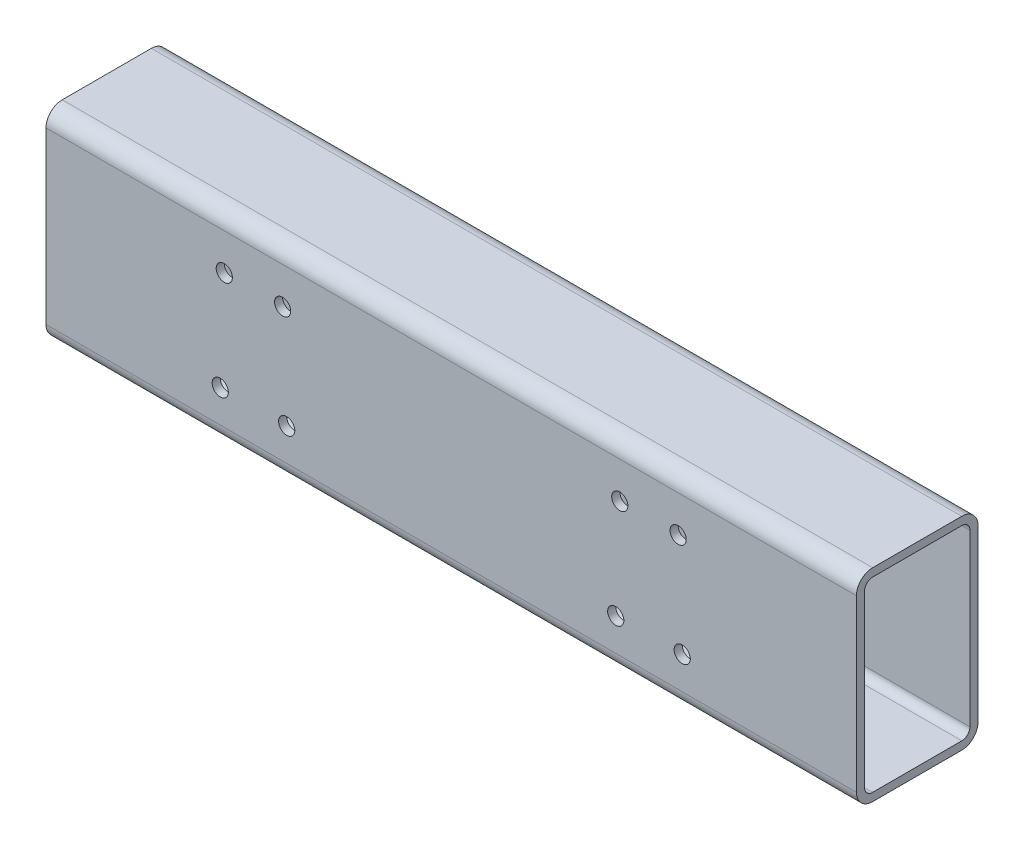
ISO-10303-21;
HEADER;
FILE_DESCRIPTION(('STEP AP214'),'2;1');
FILE_NAME('part.step','',(''),(''),'','','');
FILE_SCHEMA(('AUTOMOTIVE_DESIGN { 1 0 10303 214 1 1 1 1 }'));
ENDSEC;
DATA;
#1=APPLICATION_CONTEXT('core data for automotive mechanical design processes');
#2=APPLICATION_PROTOCOL_DEFINITION('international standard','automotive_design',2000,#1);
#3=PRODUCT_CONTEXT('',#1,'mechanical');
#4=PRODUCT('Part','Part','',(#3));
#5=PRODUCT_RELATED_PRODUCT_CATEGORY('part','',(#4));
#6=PRODUCT_DEFINITION_FORMATION('','',#4);
#7=PRODUCT_DEFINITION_CONTEXT('part definition',#1,'design');
#8=PRODUCT_DEFINITION('design','',#6,#7);
#9=PRODUCT_DEFINITION_SHAPE('','',#8);
#10=(LENGTH_UNIT() NAMED_UNIT(*) SI_UNIT(.MILLI.,.METRE.));
#11=(NAMED_UNIT(*) PLANE_ANGLE_UNIT() SI_UNIT($,.RADIAN.));
#12=(NAMED_UNIT(*) SI_UNIT($,.STERADIAN.) SOLID_ANGLE_UNIT());
#13=UNCERTAINTY_MEASURE_WITH_UNIT(LENGTH_MEASURE(1.E-05),#10,'distance_accuracy_value','');
#14=(GEOMETRIC_REPRESENTATION_CONTEXT(3) GLOBAL_UNCERTAINTY_ASSIGNED_CONTEXT((#13)) GLOBAL_UNIT_ASSIGNED_CONTEXT((#10,
#11,#12)) REPRESENTATION_CONTEXT('',''));
#15=CARTESIAN_POINT('',(0.,0.,0.));
#16=DIRECTION('',(0.,0.,1.));
#17=DIRECTION('',(1.,0.,0.));
#18=AXIS2_PLACEMENT_3D('',#15,#16,#17);
#19=CARTESIAN_POINT('',(500.,-105.,55.));
#20=DIRECTION('',(-1.,0.,0.));
#21=DIRECTION('',(0.,0.,1.));
#22=AXIS2_PLACEMENT_3D('',#19,#20,#21);
#23=CYLINDRICAL_SURFACE('',#22,20.);
#24=CARTESIAN_POINT('',(-500.,-105.,55.));
#25=DIRECTION('',(1.,0.,0.));
#26=DIRECTION('',(0.,0.,-1.));
#27=AXIS2_PLACEMENT_3D('',#24,#25,#26);
#28=CIRCLE('',#27,20.);
#29=CARTESIAN_POINT('',(-500.,-105.,75.));
#30=VERTEX_POINT('',#29);
#31=CARTESIAN_POINT('',(-500.,-125.,55.));
#32=VERTEX_POINT('',#31);
#33=EDGE_CURVE('E203',#30,#32,#28,.T.);
#34=ORIENTED_EDGE('',*,*,#33,.T.);
#35=DIRECTION('',(-1.,0.,0.));
#36=VECTOR('',#35,1.);
#37=CARTESIAN_POINT('',(500.,-125.,55.));
#38=LINE('',#37,#36);
#39=CARTESIAN_POINT('',(500.,-125.,55.));
#40=VERTEX_POINT('',#39);
#41=EDGE_CURVE('E11',#40,#32,#38,.T.);
#42=ORIENTED_EDGE('',*,*,#41,.F.);
#43=CARTESIAN_POINT('',(500.,-105.,55.));
#44=DIRECTION('',(1.,0.,0.));
#45=DIRECTION('',(0.,0.,-1.));
#46=AXIS2_PLACEMENT_3D('',#43,#44,#45);
#47=CIRCLE('',#46,20.);
#48=CARTESIAN_POINT('',(500.,-105.,75.));
#49=VERTEX_POINT('',#48);
#50=EDGE_CURVE('E184',#49,#40,#47,.T.);
#51=ORIENTED_EDGE('',*,*,#50,.F.);
#52=DIRECTION('',(-1.,0.,0.));
#53=VECTOR('',#52,1.);
#54=CARTESIAN_POINT('',(500.,-105.,75.));
#55=LINE('',#54,#53);
#56=EDGE_CURVE('E202',#49,#30,#55,.T.);
#57=ORIENTED_EDGE('',*,*,#56,.T.);
#58=EDGE_LOOP('',(#34,#42,#51,#57));
#59=FACE_BOUND('',#58,.T.);
#60=ADVANCED_FACE('F17',(#59),#23,.T.);
#61=CARTESIAN_POINT('',(500.,-125.,55.));
#62=DIRECTION('',(0.,1.,0.));
#63=DIRECTION('',(0.,0.,1.));
#64=AXIS2_PLACEMENT_3D('',#61,#62,#63);
#65=PLANE('',#64);
#66=DIRECTION('',(0.,0.,-1.));
#67=VECTOR('',#66,1.);
#68=CARTESIAN_POINT('',(-500.,-125.,55.));
#69=LINE('',#68,#67);
#70=CARTESIAN_POINT('',(-500.,-125.,-55.));
#71=VERTEX_POINT('',#70);
#72=EDGE_CURVE('E206',#32,#71,#69,.T.);
#73=ORIENTED_EDGE('',*,*,#72,.T.);
#74=DIRECTION('',(-1.,0.,0.));
#75=VECTOR('',#74,1.);
#76=CARTESIAN_POINT('',(500.,-125.,-55.));
#77=LINE('',#76,#75);
#78=CARTESIAN_POINT('',(500.,-125.,-55.));
#79=VERTEX_POINT('',#78);
#80=EDGE_CURVE('E24',#79,#71,#77,.T.);
#81=ORIENTED_EDGE('',*,*,#80,.F.);
#82=DIRECTION('',(0.,0.,-1.));
#83=VECTOR('',#82,1.);
#84=CARTESIAN_POINT('',(500.,-125.,55.));
#85=LINE('',#84,#83);
#86=EDGE_CURVE('E187',#40,#79,#85,.T.);
#87=ORIENTED_EDGE('',*,*,#86,.F.);
#88=ORIENTED_EDGE('',*,*,#41,.T.);
#89=EDGE_LOOP('',(#73,#81,#87,#88));
#90=FACE_BOUND('',#89,.T.);
#91=ADVANCED_FACE('F261',(#90),#65,.F.);
#92=CARTESIAN_POINT('',(500.,-105.,-55.));
#93=DIRECTION('',(-1.,0.,0.));
#94=DIRECTION('',(0.,0.,1.));
#95=AXIS2_PLACEMENT_3D('',#92,#93,#94);
#96=CYLINDRICAL_SURFACE('',#95,20.);
#97=CARTESIAN_POINT('',(-500.,-105.,-55.));
#98=DIRECTION('',(1.,0.,0.));
#99=DIRECTION('',(0.,0.,-1.));
#100=AXIS2_PLACEMENT_3D('',#97,#98,#99);
#101=CIRCLE('',#100,20.);
#102=CARTESIAN_POINT('',(-500.,-105.,-75.));
#103=VERTEX_POINT('',#102);
#104=EDGE_CURVE('E208',#71,#103,#101,.T.);
#105=ORIENTED_EDGE('',*,*,#104,.T.);
#106=DIRECTION('',(-1.,0.,0.));
#107=VECTOR('',#106,1.);
#108=CARTESIAN_POINT('',(500.,-105.,-75.));
#109=LINE('',#108,#107);
#110=CARTESIAN_POINT('',(500.,-105.,-75.));
#111=VERTEX_POINT('',#110);
#112=EDGE_CURVE('E233',#111,#103,#109,.T.);
#113=ORIENTED_EDGE('',*,*,#112,.F.);
#114=CARTESIAN_POINT('',(500.,-105.,-55.));
#115=DIRECTION('',(1.,0.,0.));
#116=DIRECTION('',(0.,0.,-1.));
#117=AXIS2_PLACEMENT_3D('',#114,#115,#116);
#118=CIRCLE('',#117,20.);
#119=EDGE_CURVE('E190',#79,#111,#118,.T.);
#120=ORIENTED_EDGE('',*,*,#119,.F.);
#121=ORIENTED_EDGE('',*,*,#80,.T.);
#122=EDGE_LOOP('',(#105,#113,#120,#121));
#123=FACE_BOUND('',#122,.T.);
#124=ADVANCED_FACE('F240',(#123),#96,.T.);
#125=CARTESIAN_POINT('',(500.,105.,-75.));
#126=DIRECTION('',(0.,0.,1.));
#127=DIRECTION('',(0.,-1.,0.));
#128=AXIS2_PLACEMENT_3D('',#125,#126,#127);
#129=PLANE('',#128);
#130=DIRECTION('',(0.,1.,0.));
#131=VECTOR('',#130,1.);
#132=CARTESIAN_POINT('',(-500.,105.,-75.));
#133=LINE('',#132,#131);
#134=CARTESIAN_POINT('',(-500.,105.,-75.));
#135=VERTEX_POINT('',#134);
#136=EDGE_CURVE('E210',#103,#135,#133,.T.);
#137=ORIENTED_EDGE('',*,*,#136,.T.);
#138=DIRECTION('',(-1.,0.,0.));
#139=VECTOR('',#138,1.);
#140=CARTESIAN_POINT('',(500.,105.,-75.));
#141=LINE('',#140,#139);
#142=CARTESIAN_POINT('',(500.,105.,-75.));
#143=VERTEX_POINT('',#142);
#144=EDGE_CURVE('E230',#143,#135,#141,.T.);
#145=ORIENTED_EDGE('',*,*,#144,.F.);
#146=DIRECTION('',(0.,1.,0.));
#147=VECTOR('',#146,1.);
#148=CARTESIAN_POINT('',(500.,105.,-75.));
#149=LINE('',#148,#147);
#150=EDGE_CURVE('E192',#111,#143,#149,.T.);
#151=ORIENTED_EDGE('',*,*,#150,.F.);
#152=ORIENTED_EDGE('',*,*,#112,.T.);
#153=EDGE_LOOP('',(#137,#145,#151,#152));
#154=FACE_BOUND('',#153,.T.);
#155=ADVANCED_FACE('F249',(#154),#129,.F.);
#156=CARTESIAN_POINT('',(500.,105.,-55.));
#157=DIRECTION('',(-1.,0.,0.));
#158=DIRECTION('',(0.,0.,1.));
#159=AXIS2_PLACEMENT_3D('',#156,#157,#158);
#160=CYLINDRICAL_SURFACE('',#159,20.);
#161=CARTESIAN_POINT('',(-500.,105.,-55.));
#162=DIRECTION('',(1.,0.,0.));
#163=DIRECTION('',(0.,0.,1.));
#164=AXIS2_PLACEMENT_3D('',#161,#162,#163);
#165=CIRCLE('',#164,20.);
#166=CARTESIAN_POINT('',(-500.,125.,-55.));
#167=VERTEX_POINT('',#166);
#168=EDGE_CURVE('E212',#135,#167,#165,.T.);
#169=ORIENTED_EDGE('',*,*,#168,.T.);
#170=DIRECTION('',(-1.,0.,0.));
#171=VECTOR('',#170,1.);
#172=CARTESIAN_POINT('',(500.,125.,-55.));
#173=LINE('',#172,#171);
#174=CARTESIAN_POINT('',(500.,125.,-55.));
#175=VERTEX_POINT('',#174);
#176=EDGE_CURVE('E227',#175,#167,#173,.T.);
#177=ORIENTED_EDGE('',*,*,#176,.F.);
#178=CARTESIAN_POINT('',(500.,105.,-55.));
#179=DIRECTION('',(1.,0.,0.));
#180=DIRECTION('',(0.,0.,1.));
#181=AXIS2_PLACEMENT_3D('',#178,#179,#180);
#182=CIRCLE('',#181,20.);
#183=EDGE_CURVE('E194',#143,#175,#182,.T.);
#184=ORIENTED_EDGE('',*,*,#183,.F.);
#185=ORIENTED_EDGE('',*,*,#144,.T.);
#186=EDGE_LOOP('',(#169,#177,#184,#185));
#187=FACE_BOUND('',#186,.T.);
#188=ADVANCED_FACE('F253',(#187),#160,.T.);
#189=CARTESIAN_POINT('',(500.,125.,55.));
#190=DIRECTION('',(0.,-1.,0.));
#191=DIRECTION('',(0.,0.,-1.));
#192=AXIS2_PLACEMENT_3D('',#189,#190,#191);
#193=PLANE('',#192);
#194=DIRECTION('',(0.,0.,1.));
#195=VECTOR('',#194,1.);
#196=CARTESIAN_POINT('',(-500.,125.,55.));
#197=LINE('',#196,#195);
#198=CARTESIAN_POINT('',(-500.,125.,55.));
#199=VERTEX_POINT('',#198);
#200=EDGE_CURVE('E214',#167,#199,#197,.T.);
#201=ORIENTED_EDGE('',*,*,#200,.T.);
#202=DIRECTION('',(-1.,0.,0.));
#203=VECTOR('',#202,1.);
#204=CARTESIAN_POINT('',(500.,125.,55.));
#205=LINE('',#204,#203);
#206=CARTESIAN_POINT('',(500.,125.,55.));
#207=VERTEX_POINT('',#206);
#208=EDGE_CURVE('E224',#207,#199,#205,.T.);
#209=ORIENTED_EDGE('',*,*,#208,.F.);
#210=DIRECTION('',(0.,0.,1.));
#211=VECTOR('',#210,1.);
#212=CARTESIAN_POINT('',(500.,125.,55.));
#213=LINE('',#212,#211);
#214=EDGE_CURVE('E196',#175,#207,#213,.T.);
#215=ORIENTED_EDGE('',*,*,#214,.F.);
#216=ORIENTED_EDGE('',*,*,#176,.T.);
#217=EDGE_LOOP('',(#201,#209,#215,#216));
#218=FACE_BOUND('',#217,.T.);
#219=ADVANCED_FACE('F274',(#218),#193,.F.);
#220=CARTESIAN_POINT('',(500.,105.,55.));
#221=DIRECTION('',(-1.,0.,0.));
#222=DIRECTION('',(0.,0.,1.));
#223=AXIS2_PLACEMENT_3D('',#220,#221,#222);
#224=CYLINDRICAL_SURFACE('',#223,20.);
#225=CARTESIAN_POINT('',(-500.,105.,55.));
#226=DIRECTION('',(1.,0.,0.));
#227=DIRECTION('',(0.,0.,-1.));
#228=AXIS2_PLACEMENT_3D('',#225,#226,#227);
#229=CIRCLE('',#228,20.);
#230=CARTESIAN_POINT('',(-500.,105.,75.));
#231=VERTEX_POINT('',#230);
#232=EDGE_CURVE('E216',#199,#231,#229,.T.);
#233=ORIENTED_EDGE('',*,*,#232,.T.);
#234=DIRECTION('',(-1.,0.,0.));
#235=VECTOR('',#234,1.);
#236=CARTESIAN_POINT('',(500.,105.,75.));
#237=LINE('',#236,#235);
#238=CARTESIAN_POINT('',(500.,105.,75.));
#239=VERTEX_POINT('',#238);
#240=EDGE_CURVE('E221',#239,#231,#237,.T.);
#241=ORIENTED_EDGE('',*,*,#240,.F.);
#242=CARTESIAN_POINT('',(500.,105.,55.));
#243=DIRECTION('',(1.,0.,0.));
#244=DIRECTION('',(0.,0.,-1.));
#245=AXIS2_PLACEMENT_3D('',#242,#243,#244);
#246=CIRCLE('',#245,20.);
#247=EDGE_CURVE('E198',#207,#239,#246,.T.);
#248=ORIENTED_EDGE('',*,*,#247,.F.);
#249=ORIENTED_EDGE('',*,*,#208,.T.);
#250=EDGE_LOOP('',(#233,#241,#248,#249));
#251=FACE_BOUND('',#250,.T.);
#252=ADVANCED_FACE('F272',(#251),#224,.T.);
#253=CARTESIAN_POINT('',(500.,105.,75.));
#254=DIRECTION('',(0.,0.,-1.));
#255=DIRECTION('',(0.,1.,0.));
#256=AXIS2_PLACEMENT_3D('',#253,#254,#255);
#257=PLANE('',#256);
#258=CARTESIAN_POINT('',(-203.,-65.,75.));
#259=DIRECTION('',(0.,0.,1.));
#260=DIRECTION('',(1.,0.,0.));
#261=AXIS2_PLACEMENT_3D('',#258,#259,#260);
#262=CIRCLE('',#261,10.);
#263=CARTESIAN_POINT('',(-193.,-65.,75.));
#264=VERTEX_POINT('',#263);
#265=EDGE_CURVE('E516',#264,#264,#262,.T.);
#266=ORIENTED_EDGE('',*,*,#265,.F.);
#267=EDGE_LOOP('',(#266));
#268=FACE_BOUND('',#267,.T.);
#269=CARTESIAN_POINT('',(-208.,60.,75.));
#270=DIRECTION('',(0.,0.,1.));
#271=DIRECTION('',(1.,0.,0.));
#272=AXIS2_PLACEMENT_3D('',#269,#270,#271);
#273=CIRCLE('',#272,10.);
#274=CARTESIAN_POINT('',(-198.,60.,75.));
#275=VERTEX_POINT('',#274);
#276=EDGE_CURVE('E520',#275,#275,#273,.T.);
#277=ORIENTED_EDGE('',*,*,#276,.F.);
#278=EDGE_LOOP('',(#277));
#279=FACE_BOUND('',#278,.T.);
#280=CARTESIAN_POINT('',(-280.,60.,75.));
#281=DIRECTION('',(0.,0.,1.));
#282=DIRECTION('',(1.,0.,0.));
#283=AXIS2_PLACEMENT_3D('',#280,#281,#282);
#284=CIRCLE('',#283,10.);
#285=CARTESIAN_POINT('',(-270.,60.,75.));
#286=VERTEX_POINT('',#285);
#287=EDGE_CURVE('E527',#286,#286,#284,.T.);
#288=ORIENTED_EDGE('',*,*,#287,.F.);
#289=EDGE_LOOP('',(#288));
#290=FACE_BOUND('',#289,.T.);
#291=CARTESIAN_POINT('',(-285.,-65.,75.));
#292=DIRECTION('',(0.,0.,1.));
#293=DIRECTION('',(1.,0.,0.));
#294=AXIS2_PLACEMENT_3D('',#291,#292,#293);
#295=CIRCLE('',#294,10.);
#296=CARTESIAN_POINT('',(-275.,-65.,75.));
#297=VERTEX_POINT('',#296);
#298=EDGE_CURVE('E533',#297,#297,#295,.T.);
#299=ORIENTED_EDGE('',*,*,#298,.F.);
#300=EDGE_LOOP('',(#299));
#301=FACE_BOUND('',#300,.T.);
#302=CARTESIAN_POINT('',(285.,-65.,75.));
#303=DIRECTION('',(0.,0.,1.));
#304=DIRECTION('',(1.,0.,0.));
#305=AXIS2_PLACEMENT_3D('',#302,#303,#304);
#306=CIRCLE('',#305,10.);
#307=CARTESIAN_POINT('',(295.,-65.,75.));
#308=VERTEX_POINT('',#307);
#309=EDGE_CURVE('E539',#308,#308,#306,.T.);
#310=ORIENTED_EDGE('',*,*,#309,.F.);
#311=EDGE_LOOP('',(#310));
#312=FACE_BOUND('',#311,.T.);
#313=CARTESIAN_POINT('',(203.,-65.,75.));
#314=DIRECTION('',(0.,0.,1.));
#315=DIRECTION('',(1.,0.,0.));
#316=AXIS2_PLACEMENT_3D('',#313,#314,#315);
#317=CIRCLE('',#316,10.);
#318=CARTESIAN_POINT('',(213.,-65.,75.));
#319=VERTEX_POINT('',#318);
#320=EDGE_CURVE('E545',#319,#319,#317,.T.);
#321=ORIENTED_EDGE('',*,*,#320,.F.);
#322=EDGE_LOOP('',(#321));
#323=FACE_BOUND('',#322,.T.);
#324=CARTESIAN_POINT('',(280.,60.,75.));
#325=DIRECTION('',(0.,0.,1.));
#326=DIRECTION('',(1.,0.,0.));
#327=AXIS2_PLACEMENT_3D('',#324,#325,#326);
#328=CIRCLE('',#327,10.);
#329=CARTESIAN_POINT('',(290.,60.,75.));
#330=VERTEX_POINT('',#329);
#331=EDGE_CURVE('E551',#330,#330,#328,.T.);
#332=ORIENTED_EDGE('',*,*,#331,.F.);
#333=EDGE_LOOP('',(#332));
#334=FACE_BOUND('',#333,.T.);
#335=CARTESIAN_POINT('',(208.,60.,75.));
#336=DIRECTION('',(0.,0.,1.));
#337=DIRECTION('',(1.,0.,0.));
#338=AXIS2_PLACEMENT_3D('',#335,#336,#337);
#339=CIRCLE('',#338,10.);
#340=CARTESIAN_POINT('',(218.,60.,75.));
#341=VERTEX_POINT('',#340);
#342=EDGE_CURVE('E148',#341,#341,#339,.T.);
#343=ORIENTED_EDGE('',*,*,#342,.F.);
#344=EDGE_LOOP('',(#343));
#345=FACE_BOUND('',#344,.T.);
#346=DIRECTION('',(0.,-1.,0.));
#347=VECTOR('',#346,1.);
#348=CARTESIAN_POINT('',(-500.,105.,75.));
#349=LINE('',#348,#347);
#350=EDGE_CURVE('E188',#231,#30,#349,.T.);
#351=ORIENTED_EDGE('',*,*,#350,.T.);
#352=ORIENTED_EDGE('',*,*,#56,.F.);
#353=DIRECTION('',(0.,-1.,0.));
#354=VECTOR('',#353,1.);
#355=CARTESIAN_POINT('',(500.,105.,75.));
#356=LINE('',#355,#354);
#357=EDGE_CURVE('E200',#239,#49,#356,.T.);
#358=ORIENTED_EDGE('',*,*,#357,.F.);
#359=ORIENTED_EDGE('',*,*,#240,.T.);
#360=EDGE_LOOP('',(#351,#352,#358,#359));
#361=FACE_BOUND('',#360,.T.);
#362=ADVANCED_FACE('F267',(#268,#279,#290,#301,#312,#323,#334,#345,#361),#257,.F.);
#363=CARTESIAN_POINT('',(500.,-105.,55.));
#364=DIRECTION('',(1.,0.,0.));
#365=DIRECTION('',(0.,0.,-1.));
#366=AXIS2_PLACEMENT_3D('',#363,#364,#365);
#367=PLANE('',#366);
#368=CARTESIAN_POINT('',(500.,-105.,55.));
#369=DIRECTION('',(1.,0.,0.));
#370=DIRECTION('',(0.,0.,-1.));
#371=AXIS2_PLACEMENT_3D('',#368,#369,#370);
#372=CIRCLE('',#371,10.);
#373=CARTESIAN_POINT('',(500.,-105.,65.));
#374=VERTEX_POINT('',#373);
#375=CARTESIAN_POINT('',(500.,-115.,55.));
#376=VERTEX_POINT('',#375);
#377=EDGE_CURVE('E155',#374,#376,#372,.T.);
#378=ORIENTED_EDGE('',*,*,#377,.F.);
#379=DIRECTION('',(0.,-1.,0.));
#380=VECTOR('',#379,1.);
#381=CARTESIAN_POINT('',(500.,105.,65.));
#382=LINE('',#381,#380);
#383=CARTESIAN_POINT('',(500.,105.,65.));
#384=VERTEX_POINT('',#383);
#385=EDGE_CURVE('E135',#384,#374,#382,.T.);
#386=ORIENTED_EDGE('',*,*,#385,.F.);
#387=CARTESIAN_POINT('',(500.,105.,55.));
#388=DIRECTION('',(1.,0.,0.));
#389=DIRECTION('',(0.,0.,-1.));
#390=AXIS2_PLACEMENT_3D('',#387,#388,#389);
#391=CIRCLE('',#390,10.);
#392=CARTESIAN_POINT('',(500.,115.,55.));
#393=VERTEX_POINT('',#392);
#394=EDGE_CURVE('E181',#393,#384,#391,.T.);
#395=ORIENTED_EDGE('',*,*,#394,.F.);
#396=DIRECTION('',(0.,0.,1.));
#397=VECTOR('',#396,1.);
#398=CARTESIAN_POINT('',(500.,115.,55.));
#399=LINE('',#398,#397);
#400=CARTESIAN_POINT('',(500.,115.,-55.));
#401=VERTEX_POINT('',#400);
#402=EDGE_CURVE('E179',#401,#393,#399,.T.);
#403=ORIENTED_EDGE('',*,*,#402,.F.);
#404=CARTESIAN_POINT('',(500.,105.,-55.));
#405=DIRECTION('',(1.,0.,0.));
#406=DIRECTION('',(0.,0.,-1.));
#407=AXIS2_PLACEMENT_3D('',#404,#405,#406);
#408=CIRCLE('',#407,10.);
#409=CARTESIAN_POINT('',(500.,105.,-65.));
#410=VERTEX_POINT('',#409);
#411=EDGE_CURVE('E177',#410,#401,#408,.T.);
#412=ORIENTED_EDGE('',*,*,#411,.F.);
#413=DIRECTION('',(0.,1.,0.));
#414=VECTOR('',#413,1.);
#415=CARTESIAN_POINT('',(500.,105.,-65.));
#416=LINE('',#415,#414);
#417=CARTESIAN_POINT('',(500.,-105.,-65.));
#418=VERTEX_POINT('',#417);
#419=EDGE_CURVE('E175',#418,#410,#416,.T.);
#420=ORIENTED_EDGE('',*,*,#419,.F.);
#421=CARTESIAN_POINT('',(500.,-105.,-55.));
#422=DIRECTION('',(1.,0.,0.));
#423=DIRECTION('',(0.,0.,-1.));
#424=AXIS2_PLACEMENT_3D('',#421,#422,#423);
#425=CIRCLE('',#424,10.);
#426=CARTESIAN_POINT('',(500.,-115.,-55.));
#427=VERTEX_POINT('',#426);
#428=EDGE_CURVE('E173',#427,#418,#425,.T.);
#429=ORIENTED_EDGE('',*,*,#428,.F.);
#430=DIRECTION('',(0.,0.,-1.));
#431=VECTOR('',#430,1.);
#432=CARTESIAN_POINT('',(500.,-115.,55.));
#433=LINE('',#432,#431);
#434=EDGE_CURVE('E157',#376,#427,#433,.T.);
#435=ORIENTED_EDGE('',*,*,#434,.F.);
#436=EDGE_LOOP('',(#378,#386,#395,#403,#412,#420,#429,#435));
#437=FACE_BOUND('',#436,.T.);
#438=ORIENTED_EDGE('',*,*,#50,.T.);
#439=ORIENTED_EDGE('',*,*,#86,.T.);
#440=ORIENTED_EDGE('',*,*,#119,.T.);
#441=ORIENTED_EDGE('',*,*,#150,.T.);
#442=ORIENTED_EDGE('',*,*,#183,.T.);
#443=ORIENTED_EDGE('',*,*,#214,.T.);
#444=ORIENTED_EDGE('',*,*,#247,.T.);
#445=ORIENTED_EDGE('',*,*,#357,.T.);
#446=EDGE_LOOP('',(#438,#439,#440,#441,#442,#443,#444,#445));
#447=FACE_BOUND('',#446,.T.);
#448=ADVANCED_FACE('F257',(#437,#447),#367,.T.);
#449=CARTESIAN_POINT('',(-500.,-105.,55.));
#450=DIRECTION('',(1.,0.,0.));
#451=DIRECTION('',(0.,0.,-1.));
#452=AXIS2_PLACEMENT_3D('',#449,#450,#451);
#453=PLANE('',#452);
#454=DIRECTION('',(0.,-1.,0.));
#455=VECTOR('',#454,1.);
#456=CARTESIAN_POINT('',(-500.,105.,65.));
#457=LINE('',#456,#455);
#458=CARTESIAN_POINT('',(-500.,105.,65.));
#459=VERTEX_POINT('',#458);
#460=CARTESIAN_POINT('',(-500.,-105.,65.));
#461=VERTEX_POINT('',#460);
#462=EDGE_CURVE('E132',#459,#461,#457,.T.);
#463=ORIENTED_EDGE('',*,*,#462,.T.);
#464=CARTESIAN_POINT('',(-500.,-105.,55.));
#465=DIRECTION('',(1.,0.,0.));
#466=DIRECTION('',(0.,0.,-1.));
#467=AXIS2_PLACEMENT_3D('',#464,#465,#466);
#468=CIRCLE('',#467,10.);
#469=CARTESIAN_POINT('',(-500.,-115.,55.));
#470=VERTEX_POINT('',#469);
#471=EDGE_CURVE('E141',#461,#470,#468,.T.);
#472=ORIENTED_EDGE('',*,*,#471,.T.);
#473=DIRECTION('',(0.,0.,-1.));
#474=VECTOR('',#473,1.);
#475=CARTESIAN_POINT('',(-500.,-115.,55.));
#476=LINE('',#475,#474);
#477=CARTESIAN_POINT('',(-500.,-115.,-55.));
#478=VERTEX_POINT('',#477);
#479=EDGE_CURVE('E147',#470,#478,#476,.T.);
#480=ORIENTED_EDGE('',*,*,#479,.T.);
#481=CARTESIAN_POINT('',(-500.,-105.,-55.));
#482=DIRECTION('',(1.,0.,0.));
#483=DIRECTION('',(0.,0.,-1.));
#484=AXIS2_PLACEMENT_3D('',#481,#482,#483);
#485=CIRCLE('',#484,10.);
#486=CARTESIAN_POINT('',(-500.,-105.,-65.));
#487=VERTEX_POINT('',#486);
#488=EDGE_CURVE('E39',#478,#487,#485,.T.);
#489=ORIENTED_EDGE('',*,*,#488,.T.);
#490=DIRECTION('',(0.,1.,0.));
#491=VECTOR('',#490,1.);
#492=CARTESIAN_POINT('',(-500.,105.,-65.));
#493=LINE('',#492,#491);
#494=CARTESIAN_POINT('',(-500.,105.,-65.));
#495=VERTEX_POINT('',#494);
#496=EDGE_CURVE('E167',#487,#495,#493,.T.);
#497=ORIENTED_EDGE('',*,*,#496,.T.);
#498=CARTESIAN_POINT('',(-500.,105.,-55.));
#499=DIRECTION('',(1.,0.,0.));
#500=DIRECTION('',(0.,0.,-1.));
#501=AXIS2_PLACEMENT_3D('',#498,#499,#500);
#502=CIRCLE('',#501,10.);
#503=CARTESIAN_POINT('',(-500.,115.,-55.));
#504=VERTEX_POINT('',#503);
#505=EDGE_CURVE('E164',#495,#504,#502,.T.);
#506=ORIENTED_EDGE('',*,*,#505,.T.);
#507=DIRECTION('',(0.,0.,1.));
#508=VECTOR('',#507,1.);
#509=CARTESIAN_POINT('',(-500.,115.,55.));
#510=LINE('',#509,#508);
#511=CARTESIAN_POINT('',(-500.,115.,55.));
#512=VERTEX_POINT('',#511);
#513=EDGE_CURVE('E159',#504,#512,#510,.T.);
#514=ORIENTED_EDGE('',*,*,#513,.T.);
#515=CARTESIAN_POINT('',(-500.,105.,55.));
#516=DIRECTION('',(1.,0.,0.));
#517=DIRECTION('',(0.,0.,-1.));
#518=AXIS2_PLACEMENT_3D('',#515,#516,#517);
#519=CIRCLE('',#518,10.);
#520=EDGE_CURVE('E154',#512,#459,#519,.T.);
#521=ORIENTED_EDGE('',*,*,#520,.T.);
#522=EDGE_LOOP('',(#463,#472,#480,#489,#497,#506,#514,#521));
#523=FACE_BOUND('',#522,.T.);
#524=ORIENTED_EDGE('',*,*,#33,.F.);
#525=ORIENTED_EDGE('',*,*,#350,.F.);
#526=ORIENTED_EDGE('',*,*,#232,.F.);
#527=ORIENTED_EDGE('',*,*,#200,.F.);
#528=ORIENTED_EDGE('',*,*,#168,.F.);
#529=ORIENTED_EDGE('',*,*,#136,.F.);
#530=ORIENTED_EDGE('',*,*,#104,.F.);
#531=ORIENTED_EDGE('',*,*,#72,.F.);
#532=EDGE_LOOP('',(#524,#525,#526,#527,#528,#529,#530,#531));
#533=FACE_BOUND('',#532,.T.);
#534=ADVANCED_FACE('F150',(#523,#533),#453,.F.);
#535=CARTESIAN_POINT('',(500.,-105.,55.));
#536=DIRECTION('',(-1.,0.,0.));
#537=DIRECTION('',(0.,0.,1.));
#538=AXIS2_PLACEMENT_3D('',#535,#536,#537);
#539=CYLINDRICAL_SURFACE('',#538,10.);
#540=ORIENTED_EDGE('',*,*,#471,.F.);
#541=DIRECTION('',(-1.,0.,0.));
#542=VECTOR('',#541,1.);
#543=CARTESIAN_POINT('',(500.,-105.,65.));
#544=LINE('',#543,#542);
#545=EDGE_CURVE('E128',#374,#461,#544,.T.);
#546=ORIENTED_EDGE('',*,*,#545,.F.);
#547=ORIENTED_EDGE('',*,*,#377,.T.);
#548=DIRECTION('',(1.,0.,0.));
#549=VECTOR('',#548,1.);
#550=CARTESIAN_POINT('',(500.,-115.,55.));
#551=LINE('',#550,#549);
#552=EDGE_CURVE('E144',#376,#470,#551,.F.);
#553=ORIENTED_EDGE('',*,*,#552,.T.);
#554=EDGE_LOOP('',(#540,#546,#547,#553));
#555=FACE_BOUND('',#554,.T.);
#556=ADVANCED_FACE('F142',(#555),#539,.F.);
#557=CARTESIAN_POINT('',(500.,-115.,55.));
#558=DIRECTION('',(0.,1.,0.));
#559=DIRECTION('',(0.,0.,1.));
#560=AXIS2_PLACEMENT_3D('',#557,#558,#559);
#561=PLANE('',#560);
#562=ORIENTED_EDGE('',*,*,#479,.F.);
#563=ORIENTED_EDGE('',*,*,#552,.F.);
#564=ORIENTED_EDGE('',*,*,#434,.T.);
#565=DIRECTION('',(-1.,0.,0.));
#566=VECTOR('',#565,1.);
#567=CARTESIAN_POINT('',(500.,-115.,-55.));
#568=LINE('',#567,#566);
#569=EDGE_CURVE('E561',#427,#478,#568,.T.);
#570=ORIENTED_EDGE('',*,*,#569,.T.);
#571=EDGE_LOOP('',(#562,#563,#564,#570));
#572=FACE_BOUND('',#571,.T.);
#573=ADVANCED_FACE('F357',(#572),#561,.T.);
#574=CARTESIAN_POINT('',(500.,-105.,-55.));
#575=DIRECTION('',(-1.,0.,0.));
#576=DIRECTION('',(0.,0.,1.));
#577=AXIS2_PLACEMENT_3D('',#574,#575,#576);
#578=CYLINDRICAL_SURFACE('',#577,10.);
#579=ORIENTED_EDGE('',*,*,#488,.F.);
#580=ORIENTED_EDGE('',*,*,#569,.F.);
#581=ORIENTED_EDGE('',*,*,#428,.T.);
#582=DIRECTION('',(1.,0.,0.));
#583=VECTOR('',#582,1.);
#584=CARTESIAN_POINT('',(500.,-105.,-65.));
#585=LINE('',#584,#583);
#586=EDGE_CURVE('E564',#418,#487,#585,.F.);
#587=ORIENTED_EDGE('',*,*,#586,.T.);
#588=EDGE_LOOP('',(#579,#580,#581,#587));
#589=FACE_BOUND('',#588,.T.);
#590=ADVANCED_FACE('F366',(#589),#578,.F.);
#591=CARTESIAN_POINT('',(500.,105.,-65.));
#592=DIRECTION('',(0.,0.,1.));
#593=DIRECTION('',(0.,-1.,0.));
#594=AXIS2_PLACEMENT_3D('',#591,#592,#593);
#595=PLANE('',#594);
#596=ORIENTED_EDGE('',*,*,#496,.F.);
#597=ORIENTED_EDGE('',*,*,#586,.F.);
#598=ORIENTED_EDGE('',*,*,#419,.T.);
#599=DIRECTION('',(-1.,0.,0.));
#600=VECTOR('',#599,1.);
#601=CARTESIAN_POINT('',(500.,105.,-65.));
#602=LINE('',#601,#600);
#603=EDGE_CURVE('E566',#410,#495,#602,.T.);
#604=ORIENTED_EDGE('',*,*,#603,.T.);
#605=EDGE_LOOP('',(#596,#597,#598,#604));
#606=FACE_BOUND('',#605,.T.);
#607=ADVANCED_FACE('F376',(#606),#595,.T.);
#608=CARTESIAN_POINT('',(500.,105.,-55.));
#609=DIRECTION('',(-1.,0.,0.));
#610=DIRECTION('',(0.,0.,1.));
#611=AXIS2_PLACEMENT_3D('',#608,#609,#610);
#612=CYLINDRICAL_SURFACE('',#611,10.);
#613=ORIENTED_EDGE('',*,*,#505,.F.);
#614=ORIENTED_EDGE('',*,*,#603,.F.);
#615=ORIENTED_EDGE('',*,*,#411,.T.);
#616=DIRECTION('',(1.,0.,0.));
#617=VECTOR('',#616,1.);
#618=CARTESIAN_POINT('',(500.,115.,-55.));
#619=LINE('',#618,#617);
#620=EDGE_CURVE('E568',#401,#504,#619,.F.);
#621=ORIENTED_EDGE('',*,*,#620,.T.);
#622=EDGE_LOOP('',(#613,#614,#615,#621));
#623=FACE_BOUND('',#622,.T.);
#624=ADVANCED_FACE('F385',(#623),#612,.F.);
#625=CARTESIAN_POINT('',(500.,115.,55.));
#626=DIRECTION('',(0.,-1.,0.));
#627=DIRECTION('',(0.,0.,-1.));
#628=AXIS2_PLACEMENT_3D('',#625,#626,#627);
#629=PLANE('',#628);
#630=ORIENTED_EDGE('',*,*,#513,.F.);
#631=ORIENTED_EDGE('',*,*,#620,.F.);
#632=ORIENTED_EDGE('',*,*,#402,.T.);
#633=DIRECTION('',(-1.,0.,0.));
#634=VECTOR('',#633,1.);
#635=CARTESIAN_POINT('',(500.,115.,55.));
#636=LINE('',#635,#634);
#637=EDGE_CURVE('E570',#393,#512,#636,.T.);
#638=ORIENTED_EDGE('',*,*,#637,.T.);
#639=EDGE_LOOP('',(#630,#631,#632,#638));
#640=FACE_BOUND('',#639,.T.);
#641=ADVANCED_FACE('F395',(#640),#629,.T.);
#642=CARTESIAN_POINT('',(500.,105.,55.));
#643=DIRECTION('',(-1.,0.,0.));
#644=DIRECTION('',(0.,0.,1.));
#645=AXIS2_PLACEMENT_3D('',#642,#643,#644);
#646=CYLINDRICAL_SURFACE('',#645,10.);
#647=ORIENTED_EDGE('',*,*,#520,.F.);
#648=ORIENTED_EDGE('',*,*,#637,.F.);
#649=ORIENTED_EDGE('',*,*,#394,.T.);
#650=DIRECTION('',(1.,0.,0.));
#651=VECTOR('',#650,1.);
#652=CARTESIAN_POINT('',(500.,105.,65.));
#653=LINE('',#652,#651);
#654=EDGE_CURVE('E31',#384,#459,#653,.F.);
#655=ORIENTED_EDGE('',*,*,#654,.T.);
#656=EDGE_LOOP('',(#647,#648,#649,#655));
#657=FACE_BOUND('',#656,.T.);
#658=ADVANCED_FACE('F405',(#657),#646,.F.);
#659=CARTESIAN_POINT('',(500.,105.,65.));
#660=DIRECTION('',(0.,0.,-1.));
#661=DIRECTION('',(0.,1.,0.));
#662=AXIS2_PLACEMENT_3D('',#659,#660,#661);
#663=PLANE('',#662);
#664=CARTESIAN_POINT('',(-203.,-65.,65.));
#665=DIRECTION('',(0.,0.,-1.));
#666=DIRECTION('',(0.,1.,0.));
#667=AXIS2_PLACEMENT_3D('',#664,#665,#666);
#668=CIRCLE('',#667,10.);
#669=CARTESIAN_POINT('',(-203.,-55.,65.));
#670=VERTEX_POINT('',#669);
#671=EDGE_CURVE('E513',#670,#670,#668,.F.);
#672=ORIENTED_EDGE('',*,*,#671,.T.);
#673=EDGE_LOOP('',(#672));
#674=FACE_BOUND('',#673,.T.);
#675=CARTESIAN_POINT('',(-208.,60.,65.));
#676=DIRECTION('',(0.,0.,-1.));
#677=DIRECTION('',(0.,1.,0.));
#678=AXIS2_PLACEMENT_3D('',#675,#676,#677);
#679=CIRCLE('',#678,10.);
#680=CARTESIAN_POINT('',(-208.,70.,65.));
#681=VERTEX_POINT('',#680);
#682=EDGE_CURVE('E517',#681,#681,#679,.F.);
#683=ORIENTED_EDGE('',*,*,#682,.T.);
#684=EDGE_LOOP('',(#683));
#685=FACE_BOUND('',#684,.T.);
#686=CARTESIAN_POINT('',(-280.,60.,65.));
#687=DIRECTION('',(0.,0.,-1.));
#688=DIRECTION('',(0.,1.,0.));
#689=AXIS2_PLACEMENT_3D('',#686,#687,#688);
#690=CIRCLE('',#689,10.);
#691=CARTESIAN_POINT('',(-280.,70.,65.));
#692=VERTEX_POINT('',#691);
#693=EDGE_CURVE('E525',#692,#692,#690,.F.);
#694=ORIENTED_EDGE('',*,*,#693,.T.);
#695=EDGE_LOOP('',(#694));
#696=FACE_BOUND('',#695,.T.);
#697=CARTESIAN_POINT('',(-285.,-65.,65.));
#698=DIRECTION('',(0.,0.,-1.));
#699=DIRECTION('',(0.,1.,0.));
#700=AXIS2_PLACEMENT_3D('',#697,#698,#699);
#701=CIRCLE('',#700,10.);
#702=CARTESIAN_POINT('',(-285.,-55.,65.));
#703=VERTEX_POINT('',#702);
#704=EDGE_CURVE('E530',#703,#703,#701,.F.);
#705=ORIENTED_EDGE('',*,*,#704,.T.);
#706=EDGE_LOOP('',(#705));
#707=FACE_BOUND('',#706,.T.);
#708=CARTESIAN_POINT('',(285.,-65.,65.));
#709=DIRECTION('',(0.,0.,-1.));
#710=DIRECTION('',(0.,1.,0.));
#711=AXIS2_PLACEMENT_3D('',#708,#709,#710);
#712=CIRCLE('',#711,10.);
#713=CARTESIAN_POINT('',(285.,-55.,65.));
#714=VERTEX_POINT('',#713);
#715=EDGE_CURVE('E536',#714,#714,#712,.F.);
#716=ORIENTED_EDGE('',*,*,#715,.T.);
#717=EDGE_LOOP('',(#716));
#718=FACE_BOUND('',#717,.T.);
#719=CARTESIAN_POINT('',(203.,-65.,65.));
#720=DIRECTION('',(0.,0.,-1.));
#721=DIRECTION('',(0.,1.,0.));
#722=AXIS2_PLACEMENT_3D('',#719,#720,#721);
#723=CIRCLE('',#722,10.);
#724=CARTESIAN_POINT('',(203.,-55.,65.));
#725=VERTEX_POINT('',#724);
#726=EDGE_CURVE('E542',#725,#725,#723,.F.);
#727=ORIENTED_EDGE('',*,*,#726,.T.);
#728=EDGE_LOOP('',(#727));
#729=FACE_BOUND('',#728,.T.);
#730=CARTESIAN_POINT('',(280.,60.,65.));
#731=DIRECTION('',(0.,0.,-1.));
#732=DIRECTION('',(0.,1.,0.));
#733=AXIS2_PLACEMENT_3D('',#730,#731,#732);
#734=CIRCLE('',#733,10.);
#735=CARTESIAN_POINT('',(280.,70.,65.));
#736=VERTEX_POINT('',#735);
#737=EDGE_CURVE('E548',#736,#736,#734,.F.);
#738=ORIENTED_EDGE('',*,*,#737,.T.);
#739=EDGE_LOOP('',(#738));
#740=FACE_BOUND('',#739,.T.);
#741=CARTESIAN_POINT('',(208.,60.,65.));
#742=DIRECTION('',(0.,0.,-1.));
#743=DIRECTION('',(0.,1.,0.));
#744=AXIS2_PLACEMENT_3D('',#741,#742,#743);
#745=CIRCLE('',#744,10.);
#746=CARTESIAN_POINT('',(208.,70.,65.));
#747=VERTEX_POINT('',#746);
#748=EDGE_CURVE('E554',#747,#747,#745,.F.);
#749=ORIENTED_EDGE('',*,*,#748,.T.);
#750=EDGE_LOOP('',(#749));
#751=FACE_BOUND('',#750,.T.);
#752=ORIENTED_EDGE('',*,*,#462,.F.);
#753=ORIENTED_EDGE('',*,*,#654,.F.);
#754=ORIENTED_EDGE('',*,*,#385,.T.);
#755=ORIENTED_EDGE('',*,*,#545,.T.);
#756=EDGE_LOOP('',(#752,#753,#754,#755));
#757=FACE_BOUND('',#756,.T.);
#758=ADVANCED_FACE('F130',(#674,#685,#696,#707,#718,#729,#740,#751,#757),#663,.T.);
#759=CARTESIAN_POINT('',(208.,60.,-75.001));
#760=DIRECTION('',(0.,0.,1.));
#761=DIRECTION('',(1.,0.,0.));
#762=AXIS2_PLACEMENT_3D('',#759,#760,#761);
#763=CYLINDRICAL_SURFACE('',#762,10.);
#764=ORIENTED_EDGE('',*,*,#748,.F.);
#765=EDGE_LOOP('',(#764));
#766=FACE_BOUND('',#765,.T.);
#767=ORIENTED_EDGE('',*,*,#342,.T.);
#768=EDGE_LOOP('',(#767));
#769=FACE_BOUND('',#768,.T.);
#770=ADVANCED_FACE('F424',(#766,#769),#763,.F.);
#771=CARTESIAN_POINT('',(280.,60.,-75.001));
#772=DIRECTION('',(0.,0.,1.));
#773=DIRECTION('',(1.,0.,0.));
#774=AXIS2_PLACEMENT_3D('',#771,#772,#773);
#775=CYLINDRICAL_SURFACE('',#774,10.);
#776=ORIENTED_EDGE('',*,*,#737,.F.);
#777=EDGE_LOOP('',(#776));
#778=FACE_BOUND('',#777,.T.);
#779=ORIENTED_EDGE('',*,*,#331,.T.);
#780=EDGE_LOOP('',(#779));
#781=FACE_BOUND('',#780,.T.);
#782=ADVANCED_FACE('F434',(#778,#781),#775,.F.);
#783=CARTESIAN_POINT('',(203.,-65.,-75.001));
#784=DIRECTION('',(0.,0.,1.));
#785=DIRECTION('',(1.,0.,0.));
#786=AXIS2_PLACEMENT_3D('',#783,#784,#785);
#787=CYLINDRICAL_SURFACE('',#786,10.);
#788=ORIENTED_EDGE('',*,*,#726,.F.);
#789=EDGE_LOOP('',(#788));
#790=FACE_BOUND('',#789,.T.);
#791=ORIENTED_EDGE('',*,*,#320,.T.);
#792=EDGE_LOOP('',(#791));
#793=FACE_BOUND('',#792,.T.);
#794=ADVANCED_FACE('F444',(#790,#793),#787,.F.);
#795=CARTESIAN_POINT('',(285.,-65.,-75.001));
#796=DIRECTION('',(0.,0.,1.));
#797=DIRECTION('',(1.,0.,0.));
#798=AXIS2_PLACEMENT_3D('',#795,#796,#797);
#799=CYLINDRICAL_SURFACE('',#798,10.);
#800=ORIENTED_EDGE('',*,*,#715,.F.);
#801=EDGE_LOOP('',(#800));
#802=FACE_BOUND('',#801,.T.);
#803=ORIENTED_EDGE('',*,*,#309,.T.);
#804=EDGE_LOOP('',(#803));
#805=FACE_BOUND('',#804,.T.);
#806=ADVANCED_FACE('F454',(#802,#805),#799,.F.);
#807=CARTESIAN_POINT('',(-285.,-65.,-75.001));
#808=DIRECTION('',(0.,0.,1.));
#809=DIRECTION('',(1.,0.,0.));
#810=AXIS2_PLACEMENT_3D('',#807,#808,#809);
#811=CYLINDRICAL_SURFACE('',#810,10.);
#812=ORIENTED_EDGE('',*,*,#704,.F.);
#813=EDGE_LOOP('',(#812));
#814=FACE_BOUND('',#813,.T.);
#815=ORIENTED_EDGE('',*,*,#298,.T.);
#816=EDGE_LOOP('',(#815));
#817=FACE_BOUND('',#816,.T.);
#818=ADVANCED_FACE('F464',(#814,#817),#811,.F.);
#819=CARTESIAN_POINT('',(-280.,60.,-75.001));
#820=DIRECTION('',(0.,0.,1.));
#821=DIRECTION('',(1.,0.,0.));
#822=AXIS2_PLACEMENT_3D('',#819,#820,#821);
#823=CYLINDRICAL_SURFACE('',#822,10.);
#824=ORIENTED_EDGE('',*,*,#693,.F.);
#825=EDGE_LOOP('',(#824));
#826=FACE_BOUND('',#825,.T.);
#827=ORIENTED_EDGE('',*,*,#287,.T.);
#828=EDGE_LOOP('',(#827));
#829=FACE_BOUND('',#828,.T.);
#830=ADVANCED_FACE('F474',(#826,#829),#823,.F.);
#831=CARTESIAN_POINT('',(-208.,60.,-75.001));
#832=DIRECTION('',(0.,0.,1.));
#833=DIRECTION('',(1.,0.,0.));
#834=AXIS2_PLACEMENT_3D('',#831,#832,#833);
#835=CYLINDRICAL_SURFACE('',#834,10.);
#836=ORIENTED_EDGE('',*,*,#682,.F.);
#837=EDGE_LOOP('',(#836));
#838=FACE_BOUND('',#837,.T.);
#839=ORIENTED_EDGE('',*,*,#276,.T.);
#840=EDGE_LOOP('',(#839));
#841=FACE_BOUND('',#840,.T.);
#842=ADVANCED_FACE('F484',(#838,#841),#835,.F.);
#843=CARTESIAN_POINT('',(-203.,-65.,-75.001));
#844=DIRECTION('',(0.,0.,1.));
#845=DIRECTION('',(1.,0.,0.));
#846=AXIS2_PLACEMENT_3D('',#843,#844,#845);
#847=CYLINDRICAL_SURFACE('',#846,10.);
#848=ORIENTED_EDGE('',*,*,#671,.F.);
#849=EDGE_LOOP('',(#848));
#850=FACE_BOUND('',#849,.T.);
#851=ORIENTED_EDGE('',*,*,#265,.T.);
#852=EDGE_LOOP('',(#851));
#853=FACE_BOUND('',#852,.T.);
#854=ADVANCED_FACE('F494',(#850,#853),#847,.F.);
#855=CLOSED_SHELL('',(#60,#91,#124,#155,#188,#219,#252,#362,#448,#534,#556,#573,#590,#607,#624,
#641,#658,#758,#770,#782,#794,#806,#818,#830,#842,#854));
#856=MANIFOLD_SOLID_BREP('B1',#855);
#857=ADVANCED_BREP_SHAPE_REPRESENTATION('',(#18,#856),#14);
#858=SHAPE_DEFINITION_REPRESENTATION(#9,#857);
ENDSEC;
END-ISO-10303-21;
